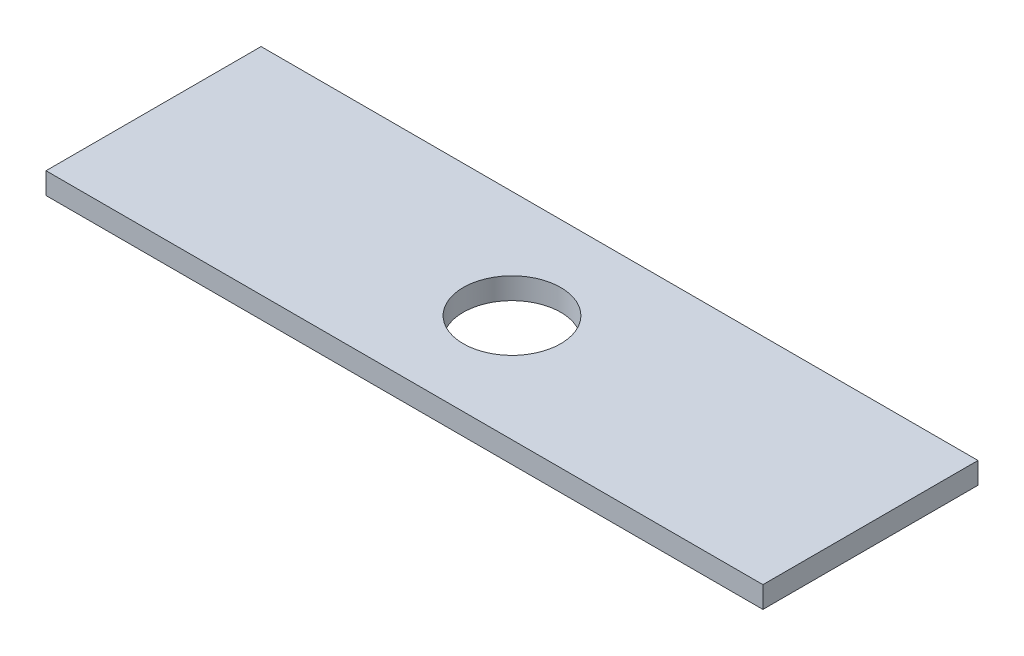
ISO-10303-21;
HEADER;
FILE_DESCRIPTION(('STEP AP214'),'2;1');
FILE_NAME('part.step','',(''),(''),'','','');
FILE_SCHEMA(('AUTOMOTIVE_DESIGN { 1 0 10303 214 1 1 1 1 }'));
ENDSEC;
DATA;
#1=APPLICATION_CONTEXT('core data for automotive mechanical design processes');
#2=APPLICATION_PROTOCOL_DEFINITION('international standard','automotive_design',2000,#1);
#3=PRODUCT_CONTEXT('',#1,'mechanical');
#4=PRODUCT('Part','Part','',(#3));
#5=PRODUCT_RELATED_PRODUCT_CATEGORY('part','',(#4));
#6=PRODUCT_DEFINITION_FORMATION('','',#4);
#7=PRODUCT_DEFINITION_CONTEXT('part definition',#1,'design');
#8=PRODUCT_DEFINITION('design','',#6,#7);
#9=PRODUCT_DEFINITION_SHAPE('','',#8);
#10=(LENGTH_UNIT() NAMED_UNIT(*) SI_UNIT(.MILLI.,.METRE.));
#11=(NAMED_UNIT(*) PLANE_ANGLE_UNIT() SI_UNIT($,.RADIAN.));
#12=(NAMED_UNIT(*) SI_UNIT($,.STERADIAN.) SOLID_ANGLE_UNIT());
#13=UNCERTAINTY_MEASURE_WITH_UNIT(LENGTH_MEASURE(1.E-05),#10,'distance_accuracy_value','');
#14=(GEOMETRIC_REPRESENTATION_CONTEXT(3) GLOBAL_UNCERTAINTY_ASSIGNED_CONTEXT((#13)) GLOBAL_UNIT_ASSIGNED_CONTEXT((#10,
#11,#12)) REPRESENTATION_CONTEXT('',''));
#15=CARTESIAN_POINT('',(0.,0.,0.));
#16=DIRECTION('',(0.,0.,1.));
#17=DIRECTION('',(1.,0.,0.));
#18=AXIS2_PLACEMENT_3D('',#15,#16,#17);
#19=CARTESIAN_POINT('',(-25.,1.5,-7.50000000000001));
#20=DIRECTION('',(0.,-1.,0.));
#21=DIRECTION('',(0.,0.,-1.));
#22=AXIS2_PLACEMENT_3D('',#19,#20,#21);
#23=PLANE('',#22);
#24=DIRECTION('',(0.,0.,1.));
#25=VECTOR('',#24,1.);
#26=CARTESIAN_POINT('',(-25.,1.5,7.49999999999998));
#27=LINE('',#26,#25);
#28=CARTESIAN_POINT('',(-25.,1.5,-7.50000000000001));
#29=VERTEX_POINT('',#28);
#30=CARTESIAN_POINT('',(-25.,1.5,7.49999999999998));
#31=VERTEX_POINT('',#30);
#32=EDGE_CURVE('E115',#29,#31,#27,.T.);
#33=ORIENTED_EDGE('',*,*,#32,.T.);
#34=DIRECTION('',(1.,0.,0.));
#35=VECTOR('',#34,1.);
#36=CARTESIAN_POINT('',(-25.,1.5,7.49999999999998));
#37=LINE('',#36,#35);
#38=CARTESIAN_POINT('',(25.,1.5,7.5));
#39=VERTEX_POINT('',#38);
#40=EDGE_CURVE('E94',#31,#39,#37,.T.);
#41=ORIENTED_EDGE('',*,*,#40,.T.);
#42=DIRECTION('',(0.,0.,-1.));
#43=VECTOR('',#42,1.);
#44=CARTESIAN_POINT('',(25.,1.5,7.5));
#45=LINE('',#44,#43);
#46=CARTESIAN_POINT('',(25.,1.5,-7.5));
#47=VERTEX_POINT('',#46);
#48=EDGE_CURVE('E59',#39,#47,#45,.T.);
#49=ORIENTED_EDGE('',*,*,#48,.T.);
#50=DIRECTION('',(-1.,0.,0.));
#51=VECTOR('',#50,1.);
#52=CARTESIAN_POINT('',(-25.,1.5,-7.50000000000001));
#53=LINE('',#52,#51);
#54=EDGE_CURVE('E54',#47,#29,#53,.T.);
#55=ORIENTED_EDGE('',*,*,#54,.T.);
#56=EDGE_LOOP('',(#33,#41,#49,#55));
#57=FACE_BOUND('',#56,.T.);
#58=CARTESIAN_POINT('',(0.,1.5,0.));
#59=DIRECTION('',(0.,1.,0.));
#60=DIRECTION('',(0.,0.,1.));
#61=AXIS2_PLACEMENT_3D('',#58,#59,#60);
#62=CIRCLE('',#61,3.4);
#63=CARTESIAN_POINT('',(0.,1.5,3.4));
#64=VERTEX_POINT('',#63);
#65=EDGE_CURVE('E100',#64,#64,#62,.T.);
#66=ORIENTED_EDGE('',*,*,#65,.F.);
#67=EDGE_LOOP('',(#66));
#68=FACE_BOUND('',#67,.T.);
#69=ADVANCED_FACE('F38',(#57,#68),#23,.F.);
#70=CARTESIAN_POINT('',(-25.,0.,-7.50000000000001));
#71=DIRECTION('',(0.,-1.,0.));
#72=DIRECTION('',(0.,0.,-1.));
#73=AXIS2_PLACEMENT_3D('',#70,#71,#72);
#74=PLANE('',#73);
#75=DIRECTION('',(0.,0.,1.));
#76=VECTOR('',#75,1.);
#77=CARTESIAN_POINT('',(-25.,0.,7.49999999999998));
#78=LINE('',#77,#76);
#79=CARTESIAN_POINT('',(-25.,0.,-7.50000000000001));
#80=VERTEX_POINT('',#79);
#81=CARTESIAN_POINT('',(-25.,0.,7.49999999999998));
#82=VERTEX_POINT('',#81);
#83=EDGE_CURVE('E85',#80,#82,#78,.T.);
#84=ORIENTED_EDGE('',*,*,#83,.F.);
#85=DIRECTION('',(-1.,0.,0.));
#86=VECTOR('',#85,1.);
#87=CARTESIAN_POINT('',(-25.,0.,-7.50000000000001));
#88=LINE('',#87,#86);
#89=CARTESIAN_POINT('',(25.,0.,-7.5));
#90=VERTEX_POINT('',#89);
#91=EDGE_CURVE('E112',#90,#80,#88,.T.);
#92=ORIENTED_EDGE('',*,*,#91,.F.);
#93=DIRECTION('',(0.,0.,-1.));
#94=VECTOR('',#93,1.);
#95=CARTESIAN_POINT('',(25.,0.,7.5));
#96=LINE('',#95,#94);
#97=CARTESIAN_POINT('',(25.,0.,7.5));
#98=VERTEX_POINT('',#97);
#99=EDGE_CURVE('E86',#98,#90,#96,.T.);
#100=ORIENTED_EDGE('',*,*,#99,.F.);
#101=DIRECTION('',(1.,0.,0.));
#102=VECTOR('',#101,1.);
#103=CARTESIAN_POINT('',(-25.,0.,7.49999999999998));
#104=LINE('',#103,#102);
#105=EDGE_CURVE('E80',#82,#98,#104,.T.);
#106=ORIENTED_EDGE('',*,*,#105,.F.);
#107=EDGE_LOOP('',(#84,#92,#100,#106));
#108=FACE_BOUND('',#107,.T.);
#109=CARTESIAN_POINT('',(0.,0.,0.));
#110=DIRECTION('',(0.,1.,0.));
#111=DIRECTION('',(0.,0.,1.));
#112=AXIS2_PLACEMENT_3D('',#109,#110,#111);
#113=CIRCLE('',#112,3.4);
#114=CARTESIAN_POINT('',(0.,0.,3.4));
#115=VERTEX_POINT('',#114);
#116=EDGE_CURVE('E106',#115,#115,#113,.T.);
#117=ORIENTED_EDGE('',*,*,#116,.T.);
#118=EDGE_LOOP('',(#117));
#119=FACE_BOUND('',#118,.T.);
#120=ADVANCED_FACE('F81',(#108,#119),#74,.T.);
#121=CARTESIAN_POINT('',(-25.,1.5,7.49999999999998));
#122=DIRECTION('',(1.,0.,0.));
#123=DIRECTION('',(0.,0.,-1.));
#124=AXIS2_PLACEMENT_3D('',#121,#122,#123);
#125=PLANE('',#124);
#126=ORIENTED_EDGE('',*,*,#83,.T.);
#127=DIRECTION('',(0.,-1.,0.));
#128=VECTOR('',#127,1.);
#129=CARTESIAN_POINT('',(-25.,1.5,7.49999999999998));
#130=LINE('',#129,#128);
#131=EDGE_CURVE('E11',#31,#82,#130,.T.);
#132=ORIENTED_EDGE('',*,*,#131,.F.);
#133=ORIENTED_EDGE('',*,*,#32,.F.);
#134=DIRECTION('',(0.,-1.,0.));
#135=VECTOR('',#134,1.);
#136=CARTESIAN_POINT('',(-25.,1.5,-7.50000000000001));
#137=LINE('',#136,#135);
#138=EDGE_CURVE('E98',#29,#80,#137,.T.);
#139=ORIENTED_EDGE('',*,*,#138,.T.);
#140=EDGE_LOOP('',(#126,#132,#133,#139));
#141=FACE_BOUND('',#140,.T.);
#142=ADVANCED_FACE('F40',(#141),#125,.F.);
#143=CARTESIAN_POINT('',(-25.,1.5,7.49999999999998));
#144=DIRECTION('',(0.,0.,-1.));
#145=DIRECTION('',(-1.,0.,0.));
#146=AXIS2_PLACEMENT_3D('',#143,#144,#145);
#147=PLANE('',#146);
#148=ORIENTED_EDGE('',*,*,#105,.T.);
#149=DIRECTION('',(0.,-1.,0.));
#150=VECTOR('',#149,1.);
#151=CARTESIAN_POINT('',(25.,1.5,7.5));
#152=LINE('',#151,#150);
#153=EDGE_CURVE('E47',#39,#98,#152,.T.);
#154=ORIENTED_EDGE('',*,*,#153,.F.);
#155=ORIENTED_EDGE('',*,*,#40,.F.);
#156=ORIENTED_EDGE('',*,*,#131,.T.);
#157=EDGE_LOOP('',(#148,#154,#155,#156));
#158=FACE_BOUND('',#157,.T.);
#159=ADVANCED_FACE('F93',(#158),#147,.F.);
#160=CARTESIAN_POINT('',(25.,1.5,7.5));
#161=DIRECTION('',(-1.,0.,0.));
#162=DIRECTION('',(0.,0.,1.));
#163=AXIS2_PLACEMENT_3D('',#160,#161,#162);
#164=PLANE('',#163);
#165=ORIENTED_EDGE('',*,*,#99,.T.);
#166=DIRECTION('',(0.,-1.,0.));
#167=VECTOR('',#166,1.);
#168=CARTESIAN_POINT('',(25.,1.5,-7.5));
#169=LINE('',#168,#167);
#170=EDGE_CURVE('E125',#47,#90,#169,.T.);
#171=ORIENTED_EDGE('',*,*,#170,.F.);
#172=ORIENTED_EDGE('',*,*,#48,.F.);
#173=ORIENTED_EDGE('',*,*,#153,.T.);
#174=EDGE_LOOP('',(#165,#171,#172,#173));
#175=FACE_BOUND('',#174,.T.);
#176=ADVANCED_FACE('F129',(#175),#164,.F.);
#177=CARTESIAN_POINT('',(-25.,1.5,-7.50000000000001));
#178=DIRECTION('',(0.,0.,1.));
#179=DIRECTION('',(1.,0.,0.));
#180=AXIS2_PLACEMENT_3D('',#177,#178,#179);
#181=PLANE('',#180);
#182=ORIENTED_EDGE('',*,*,#91,.T.);
#183=ORIENTED_EDGE('',*,*,#138,.F.);
#184=ORIENTED_EDGE('',*,*,#54,.F.);
#185=ORIENTED_EDGE('',*,*,#170,.T.);
#186=EDGE_LOOP('',(#182,#183,#184,#185));
#187=FACE_BOUND('',#186,.T.);
#188=ADVANCED_FACE('F131',(#187),#181,.F.);
#189=CARTESIAN_POINT('',(0.,1.5,0.));
#190=DIRECTION('',(0.,-1.,0.));
#191=DIRECTION('',(0.,0.,-1.));
#192=AXIS2_PLACEMENT_3D('',#189,#190,#191);
#193=CYLINDRICAL_SURFACE('',#192,3.4);
#194=ORIENTED_EDGE('',*,*,#65,.T.);
#195=EDGE_LOOP('',(#194));
#196=FACE_BOUND('',#195,.T.);
#197=ORIENTED_EDGE('',*,*,#116,.F.);
#198=EDGE_LOOP('',(#197));
#199=FACE_BOUND('',#198,.T.);
#200=ADVANCED_FACE('F137',(#196,#199),#193,.F.);
#201=CLOSED_SHELL('',(#69,#120,#142,#159,#176,#188,#200));
#202=MANIFOLD_SOLID_BREP('B2',#201);
#203=ADVANCED_BREP_SHAPE_REPRESENTATION('',(#18,#202),#14);
#204=SHAPE_DEFINITION_REPRESENTATION(#9,#203);
ENDSEC;
END-ISO-10303-21;
